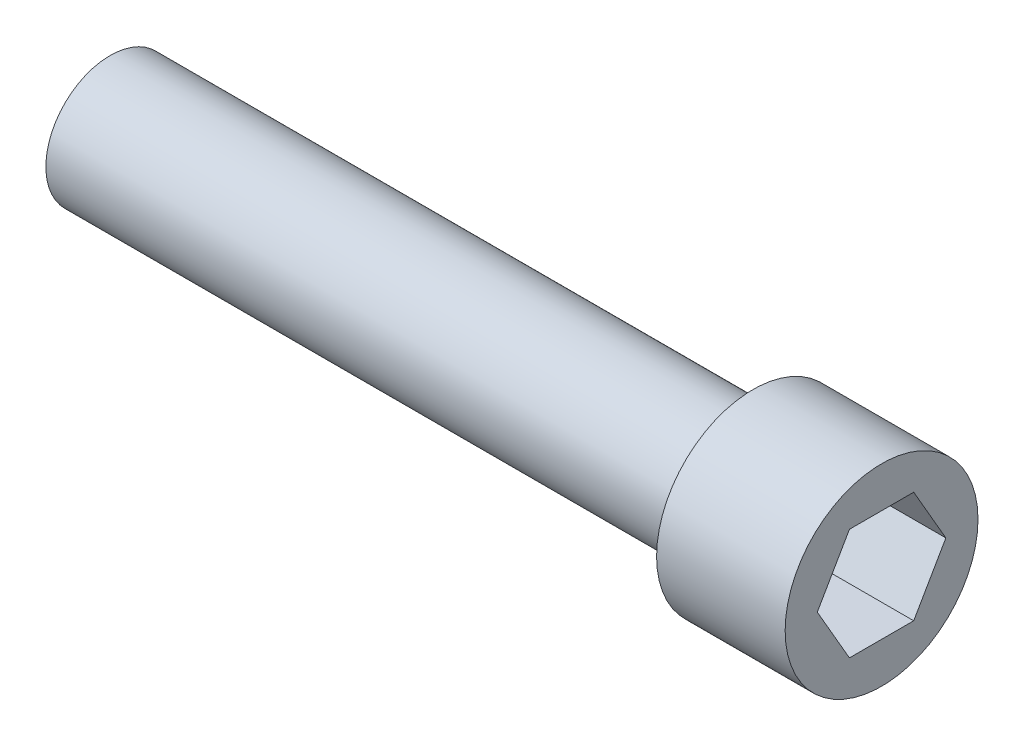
from build123d import *

# Parameters (mm, degrees)
SKETCH1_R           = 1
BOSS_EXTRUDE1_DEPTH = 10
SKETCH2_R           = 1.5
BOSS_EXTRUDE2_DEPTH = 2
CUT_EXTRUDE1_DEPTH  = 1.5


with BuildPart() as part:
    # Sketch1 → Boss-Extrude1 (new body)
    with BuildSketch(Plane(origin=(0, 0, 0), x_dir=(0, 0, -1), z_dir=(1, 0, 0))):
        Circle(SKETCH1_R)
    extrude(amount=BOSS_EXTRUDE1_DEPTH)

    # Sketch2 → Boss-Extrude2 (add)
    with BuildSketch(Plane(origin=(10, 0, 0), x_dir=(0, 0, -1), z_dir=(1, 0, 0))):
        Circle(SKETCH2_R)
    extrude(amount=BOSS_EXTRUDE2_DEPTH)

    # Sketch3 → Cut-Extrude1 (cut)
    with BuildSketch(Plane(origin=(12, 0, 0), x_dir=(0, 0, -1), z_dir=(1, 0, 0))):
        Polygon((-1, 0), (-0.5, -0.866025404), (0.5, -0.866025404), (1, 0), (0.5, 0.866025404), (-0.5, 0.866025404), align=None)
    extrude(amount=-CUT_EXTRUDE1_DEPTH, mode=Mode.SUBTRACT)


solid = part.part
